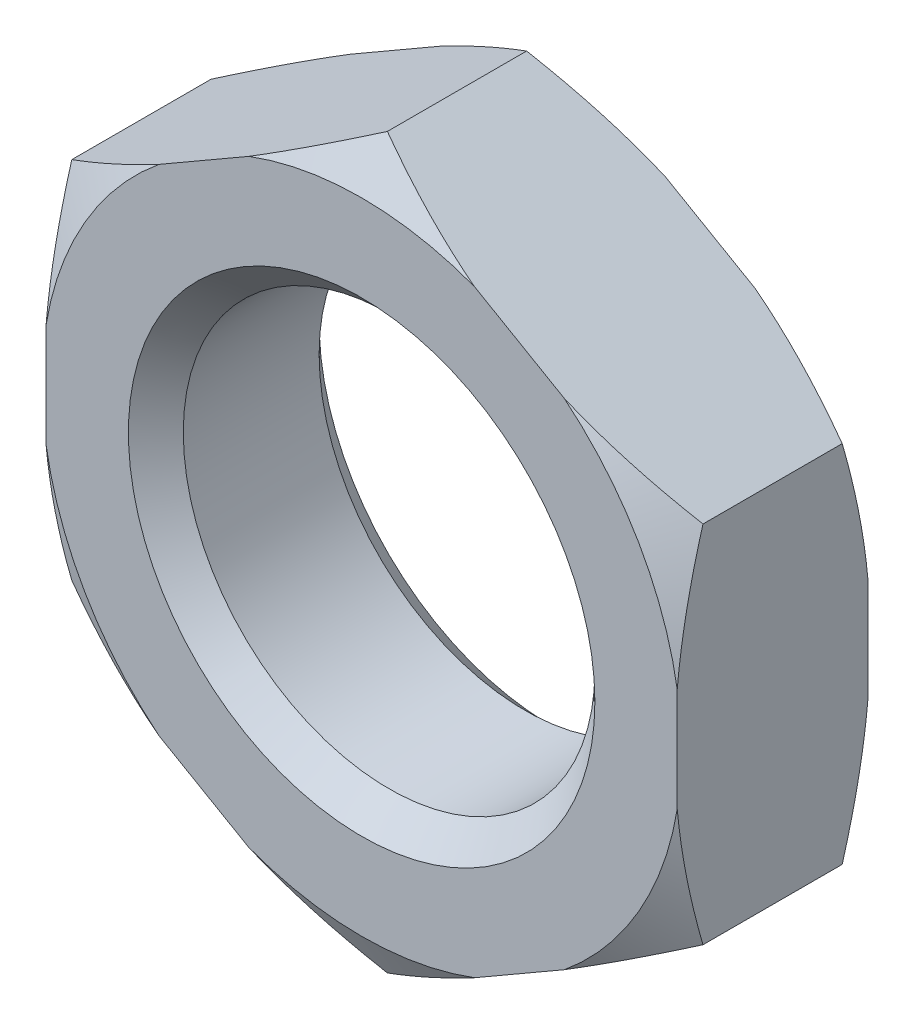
from build123d import *

# Parameters (mm, degrees)
BOSS_EXTRUDE1_DEPTH = 6.95
SKETCH6_R           = 15
CUT_EXTRUDE1_DEPTH  = 13.9
CHAMFER1_SIZE       = 2


with BuildPart() as part:
    # Sketch3 → Boss-Extrude1 (new, symmetric)
    with BuildSketch(Plane.XY):
        Polygon((0, 26.558112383), (-23, 13.279056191), (-23, -13.279056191), (0, -26.558112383), (23, -13.279056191), (23, 13.279056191), align=None)
    extrude(amount=BOSS_EXTRUDE1_DEPTH, both=True)

    # Sketch5 → Cut-Revolve1 (revolve, cut)
    with BuildSketch(Plane(origin=(0, 0, 0), x_dir=(0, 0, -1), z_dir=(1, 0, 0))):
        Polygon((-6.95, 26.558112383), (-6.95, 23.308112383), (-5.073611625, 26.558112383), align=None)
    cut_revolve1 = revolve(axis=Axis((0, 0, 5.457798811), (0, 0, -1)), mode=Mode.SUBTRACT)

    # Mirror1: Cut-Revolve1 across plane
    add(cut_revolve1.mirror(Plane.XY), mode=Mode.SUBTRACT)

    # Sketch6 → Cut-Extrude1 (cut)
    with BuildSketch(Plane.XY.offset(6.95)):
        Circle(SKETCH6_R)
    extrude(amount=-CUT_EXTRUDE1_DEPTH, mode=Mode.SUBTRACT)

    # Chamfer1
    chamfer1_edges = [part.edges().sort_by_distance(p)[0] for p in [
        (-15, 0, -6.95),
        (-15, 0, 6.95),
    ]]
    chamfer(chamfer1_edges, length=CHAMFER1_SIZE)


solid = part.part
